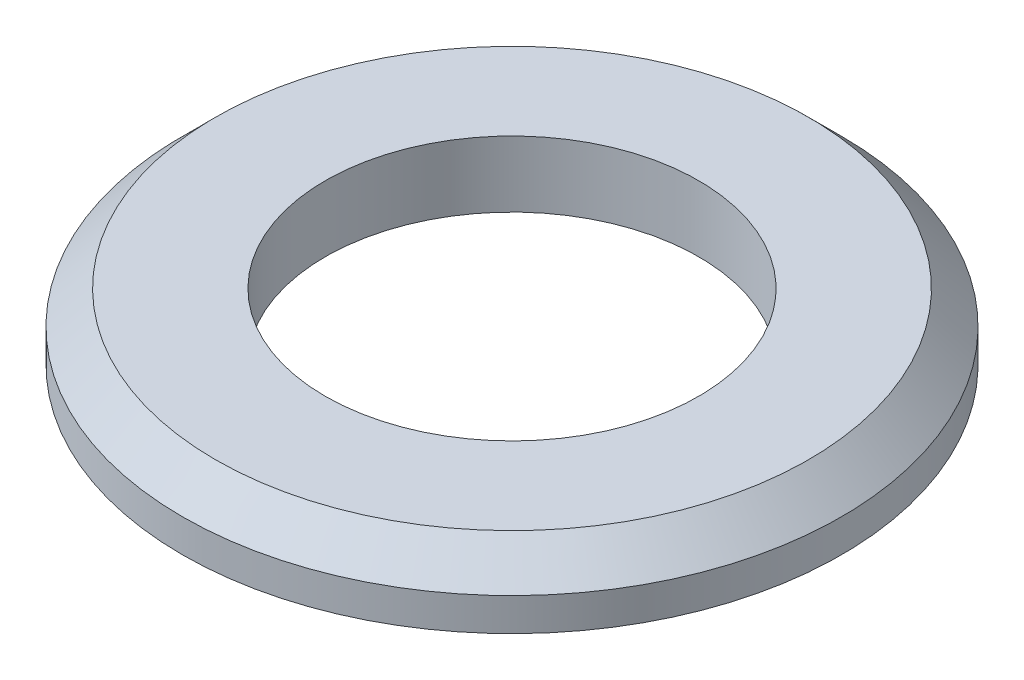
from build123d import *

# Parameters (mm, degrees)
SKETCH1_R      = 15
SKETCH1_R_2    = 8.5
EXTRUDE1_DEPTH = 3
CHAMFER1_SIZE  = 1.5


with BuildPart() as part:
    # Sketch1 → Extrude1 (new body)
    with BuildSketch(Plane(origin=(0, 0, 0), x_dir=(1, 0, 0), z_dir=(0, 1, 0))):
        with Locations(Location((0, 0, 0), (0, 0, 270))):
            Circle(SKETCH1_R)
        with Locations(Location((0, 0, 0), (0, 0, 270))):
            Circle(SKETCH1_R_2, mode=Mode.SUBTRACT)
    extrude(amount=EXTRUDE1_DEPTH)

    # Chamfer1
    chamfer1_edges = [part.edges().sort_by_distance(p)[0] for p in [
        (0, 3, -15),
    ]]
    chamfer(chamfer1_edges, length=CHAMFER1_SIZE)


solid = part.part
